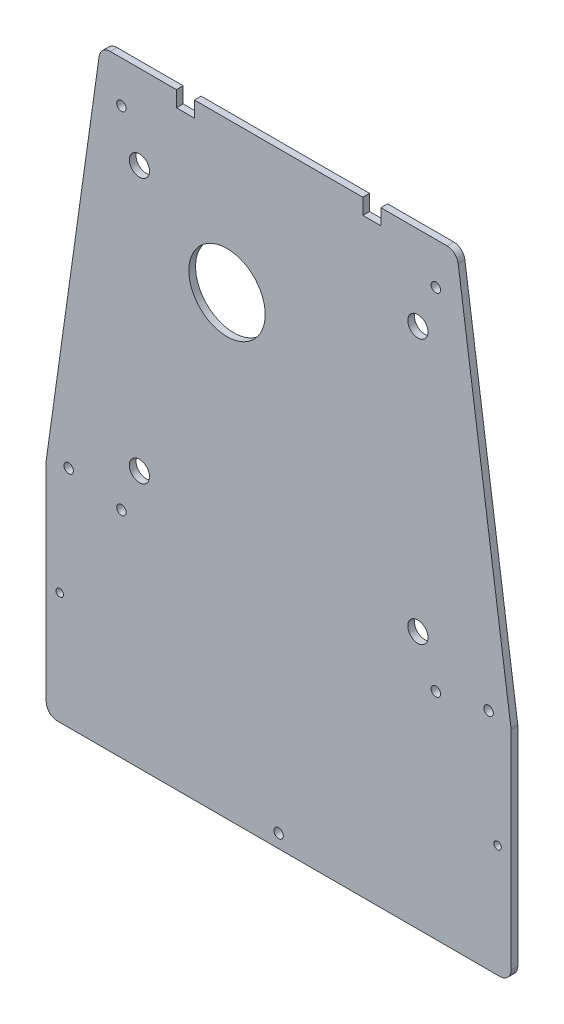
from build123d import *

# Parameters (mm, degrees)
ESQUISSE1_R               = 17
ESQUISSE1_R_2             = 4.5
ESQUISSE1_R_3             = 2.1
EXTRUSION1_DEPTH          = 3
TROU_TARAUD_M4X0_71_D     = 3.3
TROU_TARAUD_M4X0_71_DEPTH = 10.1
TROU_TARAUD_M4X0_71_TIP   = 0.991420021


with BuildPart() as part:
    # Esquisse1 → Extrusion1 (new body)
    with BuildSketch(Plane.XY):
        with BuildLine():
            Line((37.5, 96.4), (-37.5, 96.4))
            Line((-37.5, 96.4), (-37.5, 89.4))
            Line((-37.5, 89.4), (-45.5, 89.4))
            Line((-45.5, 89.4), (-45.5, 96.4))
            Line((-45.5, 96.4), (-74.980542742, 96.4))
            ThreePointArc((-74.980542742, 96.4), (-78.260837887, 95.173547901), (-79.931883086, 92.095865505))
            Line((-79.931883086, 92.095865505), (-103.451340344, -75.253768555))
            ThreePointArc((-103.451340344, -75.253768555), (-103.487820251, -75.600851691), (-103.5, -75.94963406))
            Line((-103.5, -75.94963406), (-103.5, -168.6))
            ThreePointArc((-103.5, -168.6), (-102.035533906, -172.135533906), (-98.5, -173.6))
            Line((-98.5, -173.6), (98.5, -173.6))
            ThreePointArc((98.5, -173.6), (102.035533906, -172.135533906), (103.5, -168.6))
            Line((103.5, -168.6), (103.5, -75.94963406))
            ThreePointArc((103.5, -75.94963406), (103.487820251, -75.600851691), (103.451340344, -75.253768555))
            Line((103.451340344, -75.253768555), (79.931883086, 92.095865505))
            ThreePointArc((79.931883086, 92.095865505), (78.260837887, 95.173547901), (74.980542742, 96.4))
            Line((74.980542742, 96.4), (45.5, 96.4))
            Line((45.5, 96.4), (45.5, 89.4))
            Line((45.5, 89.4), (37.5, 89.4))
            Line((37.5, 89.4), (37.5, 96.4))
        make_face()
        with Locations((-22.994, 29.4)):
            Circle(ESQUISSE1_R, mode=Mode.SUBTRACT)
        with Locations((-61.999999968, 58.9)):
            Circle(ESQUISSE1_R_2, mode=Mode.SUBTRACT)
        with Locations((-61.999999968, -58.9)):
            Circle(ESQUISSE1_R_2, mode=Mode.SUBTRACT)
        with Locations((-70, 77.9)):
            Circle(ESQUISSE1_R_3, mode=Mode.SUBTRACT)
        with Locations((-70, -77.9)):
            Circle(ESQUISSE1_R_3, mode=Mode.SUBTRACT)
        with Locations((-93.5, -73.6)):
            Circle(ESQUISSE1_R_3, mode=Mode.SUBTRACT)
        with Locations(Location((93.5, -73.6, 0), (0, 0, 180))):
            Circle(ESQUISSE1_R_3, mode=Mode.SUBTRACT)
        with Locations(Location((70, -77.9, 0), (0, 0, 180))):
            Circle(ESQUISSE1_R_3, mode=Mode.SUBTRACT)
        with Locations(Location((70, 77.9, 0), (0, 0, 180))):
            Circle(ESQUISSE1_R_3, mode=Mode.SUBTRACT)
        with Locations(Location((61.999999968, -58.9, 0), (0, 0, 180))):
            Circle(ESQUISSE1_R_2, mode=Mode.SUBTRACT)
        with Locations(Location((61.999999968, 58.9, 0), (0, 0, 180))):
            Circle(ESQUISSE1_R_2, mode=Mode.SUBTRACT)
        with Locations((0, -167.6)):
            Circle(ESQUISSE1_R_3, mode=Mode.SUBTRACT)
    extrude(amount=EXTRUSION1_DEPTH)

    # Trou taraud_ M4x0.71
    with Locations(Plane.XY.offset(3)):
        with Locations((-97.5, -123.6), (97.5, -123.6)):
            Hole(TROU_TARAUD_M4X0_71_D / 2, depth=TROU_TARAUD_M4X0_71_DEPTH)
            with Locations((0, 0, -(TROU_TARAUD_M4X0_71_DEPTH + TROU_TARAUD_M4X0_71_TIP / 2))):  # 118° drill point
                Cone(0, TROU_TARAUD_M4X0_71_D / 2, TROU_TARAUD_M4X0_71_TIP, mode=Mode.SUBTRACT)


solid = part.part
